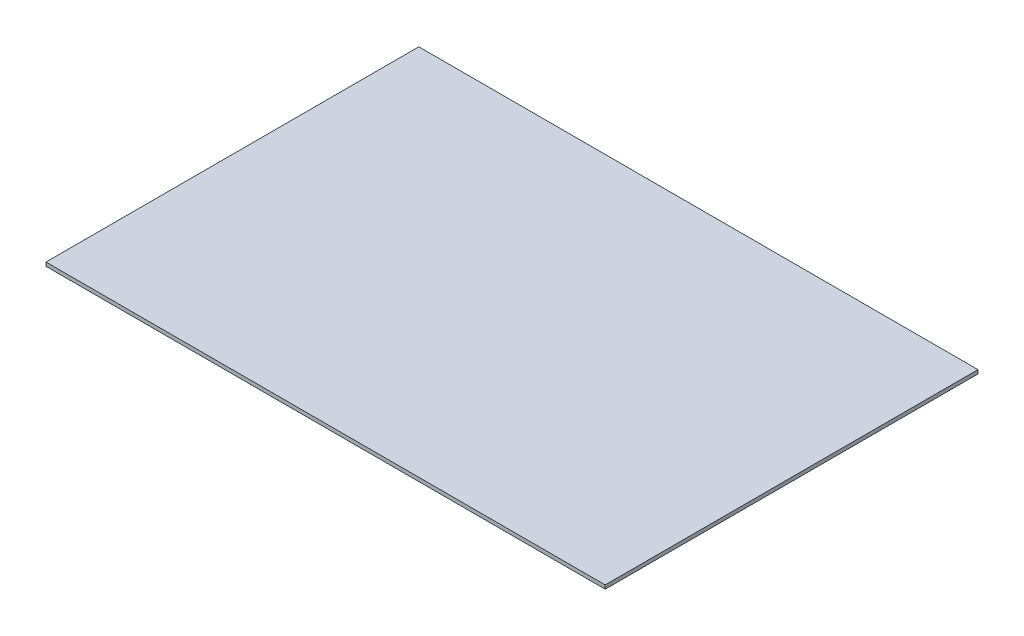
from build123d import *

# Parameters (mm, degrees)
SKETCH1_W           = 1500
SKETCH1_H           = 1000
BOSS_EXTRUDE1_DEPTH = 10


with BuildPart() as part:
    # Sketch1 → Boss-Extrude1 (new body)
    with BuildSketch(Plane(origin=(0, 0, 0), x_dir=(1, 0, 0), z_dir=(0, 1, 0))):
        Rectangle(SKETCH1_W, SKETCH1_H)
    extrude(amount=BOSS_EXTRUDE1_DEPTH)


solid = part.part
